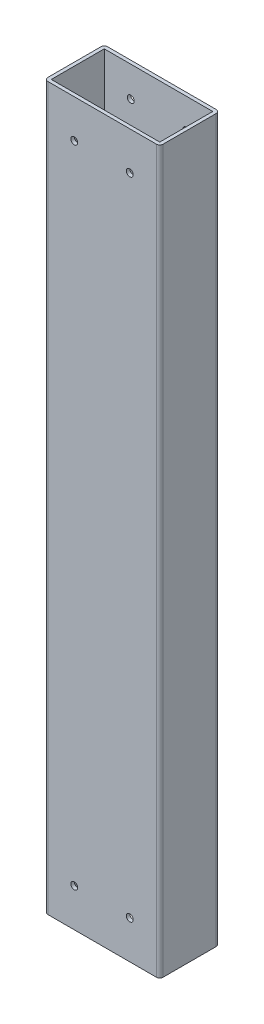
ISO-10303-21;
HEADER;
FILE_DESCRIPTION(('STEP AP214'),'2;1');
FILE_NAME('part.step','',(''),(''),'','','');
FILE_SCHEMA(('AUTOMOTIVE_DESIGN { 1 0 10303 214 1 1 1 1 }'));
ENDSEC;
DATA;
#1=APPLICATION_CONTEXT('core data for automotive mechanical design processes');
#2=APPLICATION_PROTOCOL_DEFINITION('international standard','automotive_design',2000,#1);
#3=PRODUCT_CONTEXT('',#1,'mechanical');
#4=PRODUCT('Part','Part','',(#3));
#5=PRODUCT_RELATED_PRODUCT_CATEGORY('part','',(#4));
#6=PRODUCT_DEFINITION_FORMATION('','',#4);
#7=PRODUCT_DEFINITION_CONTEXT('part definition',#1,'design');
#8=PRODUCT_DEFINITION('design','',#6,#7);
#9=PRODUCT_DEFINITION_SHAPE('','',#8);
#10=(LENGTH_UNIT() NAMED_UNIT(*) SI_UNIT(.MILLI.,.METRE.));
#11=(NAMED_UNIT(*) PLANE_ANGLE_UNIT() SI_UNIT($,.RADIAN.));
#12=(NAMED_UNIT(*) SI_UNIT($,.STERADIAN.) SOLID_ANGLE_UNIT());
#13=UNCERTAINTY_MEASURE_WITH_UNIT(LENGTH_MEASURE(1.E-05),#10,'distance_accuracy_value','');
#14=(GEOMETRIC_REPRESENTATION_CONTEXT(3) GLOBAL_UNCERTAINTY_ASSIGNED_CONTEXT((#13)) GLOBAL_UNIT_ASSIGNED_CONTEXT((#10,
#11,#12)) REPRESENTATION_CONTEXT('',''));
#15=CARTESIAN_POINT('',(0.,0.,0.));
#16=DIRECTION('',(0.,0.,1.));
#17=DIRECTION('',(1.,0.,0.));
#18=AXIS2_PLACEMENT_3D('',#15,#16,#17);
#19=CARTESIAN_POINT('',(-24.8285,165.1,12.1285));
#20=DIRECTION('',(0.,1.,0.));
#21=DIRECTION('',(0.,0.,1.));
#22=AXIS2_PLACEMENT_3D('',#19,#20,#21);
#23=PLANE('',#22);
#24=CARTESIAN_POINT('',(-24.8285,165.1,12.1285));
#25=DIRECTION('',(0.,1.,0.));
#26=DIRECTION('',(0.,0.,-1.));
#27=AXIS2_PLACEMENT_3D('',#24,#25,#26);
#28=CIRCLE('',#27,1.5875);
#29=CARTESIAN_POINT('',(-26.416,165.1,12.1285));
#30=VERTEX_POINT('',#29);
#31=CARTESIAN_POINT('',(-24.8285,165.1,13.716));
#32=VERTEX_POINT('',#31);
#33=EDGE_CURVE('E210',#30,#32,#28,.T.);
#34=ORIENTED_EDGE('',*,*,#33,.T.);
#35=DIRECTION('',(1.,0.,0.));
#36=VECTOR('',#35,1.);
#37=CARTESIAN_POINT('',(-24.8285,165.1,13.716));
#38=LINE('',#37,#36);
#39=CARTESIAN_POINT('',(24.8285,165.1,13.716));
#40=VERTEX_POINT('',#39);
#41=EDGE_CURVE('E213',#32,#40,#38,.T.);
#42=ORIENTED_EDGE('',*,*,#41,.T.);
#43=CARTESIAN_POINT('',(24.8285,165.1,12.1285));
#44=DIRECTION('',(0.,1.,0.));
#45=DIRECTION('',(0.,0.,1.));
#46=AXIS2_PLACEMENT_3D('',#43,#44,#45);
#47=CIRCLE('',#46,1.5875);
#48=CARTESIAN_POINT('',(26.416,165.1,12.1285));
#49=VERTEX_POINT('',#48);
#50=EDGE_CURVE('E216',#40,#49,#47,.T.);
#51=ORIENTED_EDGE('',*,*,#50,.T.);
#52=DIRECTION('',(0.,0.,-1.));
#53=VECTOR('',#52,1.);
#54=CARTESIAN_POINT('',(26.416,165.1,12.1285));
#55=LINE('',#54,#53);
#56=CARTESIAN_POINT('',(26.416,165.1,-12.1285));
#57=VERTEX_POINT('',#56);
#58=EDGE_CURVE('E218',#49,#57,#55,.T.);
#59=ORIENTED_EDGE('',*,*,#58,.T.);
#60=CARTESIAN_POINT('',(24.8285,165.1,-12.1285));
#61=DIRECTION('',(0.,1.,0.));
#62=DIRECTION('',(0.,0.,-1.));
#63=AXIS2_PLACEMENT_3D('',#60,#61,#62);
#64=CIRCLE('',#63,1.5875);
#65=CARTESIAN_POINT('',(24.8285,165.1,-13.716));
#66=VERTEX_POINT('',#65);
#67=EDGE_CURVE('E220',#57,#66,#64,.T.);
#68=ORIENTED_EDGE('',*,*,#67,.T.);
#69=DIRECTION('',(-1.,0.,0.));
#70=VECTOR('',#69,1.);
#71=CARTESIAN_POINT('',(-24.8285,165.1,-13.716));
#72=LINE('',#71,#70);
#73=CARTESIAN_POINT('',(-24.8285,165.1,-13.716));
#74=VERTEX_POINT('',#73);
#75=EDGE_CURVE('E222',#66,#74,#72,.T.);
#76=ORIENTED_EDGE('',*,*,#75,.T.);
#77=CARTESIAN_POINT('',(-24.8285,165.1,-12.1285));
#78=DIRECTION('',(0.,1.,0.));
#79=DIRECTION('',(0.,0.,-1.));
#80=AXIS2_PLACEMENT_3D('',#77,#78,#79);
#81=CIRCLE('',#80,1.5875);
#82=CARTESIAN_POINT('',(-26.416,165.1,-12.1285));
#83=VERTEX_POINT('',#82);
#84=EDGE_CURVE('E224',#74,#83,#81,.T.);
#85=ORIENTED_EDGE('',*,*,#84,.T.);
#86=DIRECTION('',(0.,0.,1.));
#87=VECTOR('',#86,1.);
#88=CARTESIAN_POINT('',(-26.416,165.1,12.1285));
#89=LINE('',#88,#87);
#90=EDGE_CURVE('E226',#83,#30,#89,.T.);
#91=ORIENTED_EDGE('',*,*,#90,.T.);
#92=EDGE_LOOP('',(#34,#42,#51,#59,#68,#76,#85,#91));
#93=FACE_BOUND('',#92,.T.);
#94=DIRECTION('',(1.,0.,0.));
#95=VECTOR('',#94,1.);
#96=CARTESIAN_POINT('',(-24.8285,165.1,12.1285));
#97=LINE('',#96,#95);
#98=CARTESIAN_POINT('',(-24.8285,165.1,12.1285));
#99=VERTEX_POINT('',#98);
#100=CARTESIAN_POINT('',(24.8285,165.1,12.1285));
#101=VERTEX_POINT('',#100);
#102=EDGE_CURVE('E180',#99,#101,#97,.T.);
#103=ORIENTED_EDGE('',*,*,#102,.F.);
#104=DIRECTION('',(0.,0.,1.));
#105=VECTOR('',#104,1.);
#106=CARTESIAN_POINT('',(-24.8285,165.1,12.1285));
#107=LINE('',#106,#105);
#108=CARTESIAN_POINT('',(-24.8285,165.1,-12.1285));
#109=VERTEX_POINT('',#108);
#110=EDGE_CURVE('E172',#109,#99,#107,.T.);
#111=ORIENTED_EDGE('',*,*,#110,.F.);
#112=DIRECTION('',(-1.,0.,0.));
#113=VECTOR('',#112,1.);
#114=CARTESIAN_POINT('',(-24.8285,165.1,-12.1285));
#115=LINE('',#114,#113);
#116=CARTESIAN_POINT('',(24.8285,165.1,-12.1285));
#117=VERTEX_POINT('',#116);
#118=EDGE_CURVE('E194',#117,#109,#115,.T.);
#119=ORIENTED_EDGE('',*,*,#118,.F.);
#120=DIRECTION('',(0.,0.,-1.));
#121=VECTOR('',#120,1.);
#122=CARTESIAN_POINT('',(24.8285,165.1,12.1285));
#123=LINE('',#122,#121);
#124=EDGE_CURVE('E192',#101,#117,#123,.T.);
#125=ORIENTED_EDGE('',*,*,#124,.F.);
#126=EDGE_LOOP('',(#103,#111,#119,#125));
#127=FACE_BOUND('',#126,.T.);
#128=ADVANCED_FACE('F81',(#93,#127),#23,.T.);
#129=CARTESIAN_POINT('',(-24.8285,-165.1,12.1285));
#130=DIRECTION('',(0.,1.,0.));
#131=DIRECTION('',(0.,0.,1.));
#132=AXIS2_PLACEMENT_3D('',#129,#130,#131);
#133=PLANE('',#132);
#134=CARTESIAN_POINT('',(-24.8285,-165.1,12.1285));
#135=DIRECTION('',(0.,1.,0.));
#136=DIRECTION('',(0.,0.,-1.));
#137=AXIS2_PLACEMENT_3D('',#134,#135,#136);
#138=CIRCLE('',#137,1.5875);
#139=CARTESIAN_POINT('',(-26.416,-165.1,12.1285));
#140=VERTEX_POINT('',#139);
#141=CARTESIAN_POINT('',(-24.8285,-165.1,13.716));
#142=VERTEX_POINT('',#141);
#143=EDGE_CURVE('E188',#140,#142,#138,.T.);
#144=ORIENTED_EDGE('',*,*,#143,.F.);
#145=DIRECTION('',(0.,0.,1.));
#146=VECTOR('',#145,1.);
#147=CARTESIAN_POINT('',(-26.416,-165.1,12.1285));
#148=LINE('',#147,#146);
#149=CARTESIAN_POINT('',(-26.416,-165.1,-12.1285));
#150=VERTEX_POINT('',#149);
#151=EDGE_CURVE('E214',#150,#140,#148,.T.);
#152=ORIENTED_EDGE('',*,*,#151,.F.);
#153=CARTESIAN_POINT('',(-24.8285,-165.1,-12.1285));
#154=DIRECTION('',(0.,1.,0.));
#155=DIRECTION('',(0.,0.,-1.));
#156=AXIS2_PLACEMENT_3D('',#153,#154,#155);
#157=CIRCLE('',#156,1.5875);
#158=CARTESIAN_POINT('',(-24.8285,-165.1,-13.716));
#159=VERTEX_POINT('',#158);
#160=EDGE_CURVE('E241',#159,#150,#157,.T.);
#161=ORIENTED_EDGE('',*,*,#160,.F.);
#162=DIRECTION('',(-1.,0.,0.));
#163=VECTOR('',#162,1.);
#164=CARTESIAN_POINT('',(-24.8285,-165.1,-13.716));
#165=LINE('',#164,#163);
#166=CARTESIAN_POINT('',(24.8285,-165.1,-13.716));
#167=VERTEX_POINT('',#166);
#168=EDGE_CURVE('E239',#167,#159,#165,.T.);
#169=ORIENTED_EDGE('',*,*,#168,.F.);
#170=CARTESIAN_POINT('',(24.8285,-165.1,-12.1285));
#171=DIRECTION('',(0.,1.,0.));
#172=DIRECTION('',(0.,0.,-1.));
#173=AXIS2_PLACEMENT_3D('',#170,#171,#172);
#174=CIRCLE('',#173,1.5875);
#175=CARTESIAN_POINT('',(26.416,-165.1,-12.1285));
#176=VERTEX_POINT('',#175);
#177=EDGE_CURVE('E237',#176,#167,#174,.T.);
#178=ORIENTED_EDGE('',*,*,#177,.F.);
#179=DIRECTION('',(0.,0.,-1.));
#180=VECTOR('',#179,1.);
#181=CARTESIAN_POINT('',(26.416,-165.1,12.1285));
#182=LINE('',#181,#180);
#183=CARTESIAN_POINT('',(26.416,-165.1,12.1285));
#184=VERTEX_POINT('',#183);
#185=EDGE_CURVE('E235',#184,#176,#182,.T.);
#186=ORIENTED_EDGE('',*,*,#185,.F.);
#187=CARTESIAN_POINT('',(24.8285,-165.1,12.1285));
#188=DIRECTION('',(0.,1.,0.));
#189=DIRECTION('',(0.,0.,1.));
#190=AXIS2_PLACEMENT_3D('',#187,#188,#189);
#191=CIRCLE('',#190,1.5875);
#192=CARTESIAN_POINT('',(24.8285,-165.1,13.716));
#193=VERTEX_POINT('',#192);
#194=EDGE_CURVE('E233',#193,#184,#191,.T.);
#195=ORIENTED_EDGE('',*,*,#194,.F.);
#196=DIRECTION('',(1.,0.,0.));
#197=VECTOR('',#196,1.);
#198=CARTESIAN_POINT('',(-24.8285,-165.1,13.716));
#199=LINE('',#198,#197);
#200=EDGE_CURVE('E231',#142,#193,#199,.T.);
#201=ORIENTED_EDGE('',*,*,#200,.F.);
#202=EDGE_LOOP('',(#144,#152,#161,#169,#178,#186,#195,#201));
#203=FACE_BOUND('',#202,.T.);
#204=DIRECTION('',(0.,0.,1.));
#205=VECTOR('',#204,1.);
#206=CARTESIAN_POINT('',(-24.8285,-165.1,12.1285));
#207=LINE('',#206,#205);
#208=CARTESIAN_POINT('',(-24.8285,-165.1,-12.1285));
#209=VERTEX_POINT('',#208);
#210=CARTESIAN_POINT('',(-24.8285,-165.1,12.1285));
#211=VERTEX_POINT('',#210);
#212=EDGE_CURVE('E106',#209,#211,#207,.T.);
#213=ORIENTED_EDGE('',*,*,#212,.T.);
#214=DIRECTION('',(1.,0.,0.));
#215=VECTOR('',#214,1.);
#216=CARTESIAN_POINT('',(-24.8285,-165.1,12.1285));
#217=LINE('',#216,#215);
#218=CARTESIAN_POINT('',(24.8285,-165.1,12.1285));
#219=VERTEX_POINT('',#218);
#220=EDGE_CURVE('E187',#211,#219,#217,.T.);
#221=ORIENTED_EDGE('',*,*,#220,.T.);
#222=DIRECTION('',(0.,0.,-1.));
#223=VECTOR('',#222,1.);
#224=CARTESIAN_POINT('',(24.8285,-165.1,12.1285));
#225=LINE('',#224,#223);
#226=CARTESIAN_POINT('',(24.8285,-165.1,-12.1285));
#227=VERTEX_POINT('',#226);
#228=EDGE_CURVE('E202',#219,#227,#225,.T.);
#229=ORIENTED_EDGE('',*,*,#228,.T.);
#230=DIRECTION('',(-1.,0.,0.));
#231=VECTOR('',#230,1.);
#232=CARTESIAN_POINT('',(-24.8285,-165.1,-12.1285));
#233=LINE('',#232,#231);
#234=EDGE_CURVE('E181',#227,#209,#233,.T.);
#235=ORIENTED_EDGE('',*,*,#234,.T.);
#236=EDGE_LOOP('',(#213,#221,#229,#235));
#237=FACE_BOUND('',#236,.T.);
#238=ADVANCED_FACE('F335',(#203,#237),#133,.F.);
#239=CARTESIAN_POINT('',(-24.8285,165.1,12.1285));
#240=DIRECTION('',(0.,-1.,0.));
#241=DIRECTION('',(0.,0.,-1.));
#242=AXIS2_PLACEMENT_3D('',#239,#240,#241);
#243=CYLINDRICAL_SURFACE('',#242,1.5875);
#244=ORIENTED_EDGE('',*,*,#143,.T.);
#245=DIRECTION('',(0.,-1.,0.));
#246=VECTOR('',#245,1.);
#247=CARTESIAN_POINT('',(-24.8285,165.1,13.716));
#248=LINE('',#247,#246);
#249=EDGE_CURVE('E12',#32,#142,#248,.T.);
#250=ORIENTED_EDGE('',*,*,#249,.F.);
#251=ORIENTED_EDGE('',*,*,#33,.F.);
#252=DIRECTION('',(0.,-1.,0.));
#253=VECTOR('',#252,1.);
#254=CARTESIAN_POINT('',(-26.416,165.1,12.1285));
#255=LINE('',#254,#253);
#256=EDGE_CURVE('E228',#30,#140,#255,.T.);
#257=ORIENTED_EDGE('',*,*,#256,.T.);
#258=EDGE_LOOP('',(#244,#250,#251,#257));
#259=FACE_BOUND('',#258,.T.);
#260=ADVANCED_FACE('F83',(#259),#243,.T.);
#261=CARTESIAN_POINT('',(-24.8285,165.1,13.716));
#262=DIRECTION('',(0.,0.,-1.));
#263=DIRECTION('',(-1.,0.,0.));
#264=AXIS2_PLACEMENT_3D('',#261,#262,#263);
#265=PLANE('',#264);
#266=CARTESIAN_POINT('',(12.699999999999,147.6375,13.716));
#267=DIRECTION('',(0.,0.,1.));
#268=DIRECTION('',(1.,0.,0.));
#269=AXIS2_PLACEMENT_3D('',#266,#267,#268);
#270=CIRCLE('',#269,1.58749999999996);
#271=CARTESIAN_POINT('',(14.2874999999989,147.6375,13.716));
#272=VERTEX_POINT('',#271);
#273=EDGE_CURVE('E308',#272,#272,#270,.T.);
#274=ORIENTED_EDGE('',*,*,#273,.F.);
#275=EDGE_LOOP('',(#274));
#276=FACE_BOUND('',#275,.T.);
#277=CARTESIAN_POINT('',(-12.6999999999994,147.6375,13.716));
#278=DIRECTION('',(0.,0.,1.));
#279=DIRECTION('',(1.,0.,0.));
#280=AXIS2_PLACEMENT_3D('',#277,#278,#279);
#281=CIRCLE('',#280,1.5875);
#282=CARTESIAN_POINT('',(-11.1124999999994,147.6375,13.716));
#283=VERTEX_POINT('',#282);
#284=EDGE_CURVE('E311',#283,#283,#281,.T.);
#285=ORIENTED_EDGE('',*,*,#284,.F.);
#286=EDGE_LOOP('',(#285));
#287=FACE_BOUND('',#286,.T.);
#288=CARTESIAN_POINT('',(-12.6999999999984,-147.6375,13.716));
#289=DIRECTION('',(0.,0.,1.));
#290=DIRECTION('',(1.,0.,0.));
#291=AXIS2_PLACEMENT_3D('',#288,#289,#290);
#292=CIRCLE('',#291,1.5875);
#293=CARTESIAN_POINT('',(-11.1124999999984,-147.6375,13.716));
#294=VERTEX_POINT('',#293);
#295=EDGE_CURVE('E307',#294,#294,#292,.T.);
#296=ORIENTED_EDGE('',*,*,#295,.F.);
#297=EDGE_LOOP('',(#296));
#298=FACE_BOUND('',#297,.T.);
#299=CARTESIAN_POINT('',(12.7,-147.6375,13.716));
#300=DIRECTION('',(0.,0.,1.));
#301=DIRECTION('',(1.,0.,0.));
#302=AXIS2_PLACEMENT_3D('',#299,#300,#301);
#303=CIRCLE('',#302,1.58749999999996);
#304=CARTESIAN_POINT('',(14.2874999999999,-147.6375,13.716));
#305=VERTEX_POINT('',#304);
#306=EDGE_CURVE('E279',#305,#305,#303,.T.);
#307=ORIENTED_EDGE('',*,*,#306,.F.);
#308=EDGE_LOOP('',(#307));
#309=FACE_BOUND('',#308,.T.);
#310=ORIENTED_EDGE('',*,*,#200,.T.);
#311=DIRECTION('',(0.,-1.,0.));
#312=VECTOR('',#311,1.);
#313=CARTESIAN_POINT('',(24.8285,165.1,13.716));
#314=LINE('',#313,#312);
#315=EDGE_CURVE('E90',#40,#193,#314,.T.);
#316=ORIENTED_EDGE('',*,*,#315,.F.);
#317=ORIENTED_EDGE('',*,*,#41,.F.);
#318=ORIENTED_EDGE('',*,*,#249,.T.);
#319=EDGE_LOOP('',(#310,#316,#317,#318));
#320=FACE_BOUND('',#319,.T.);
#321=ADVANCED_FACE('F319',(#276,#287,#298,#309,#320),#265,.F.);
#322=CARTESIAN_POINT('',(24.8285,165.1,12.1285));
#323=DIRECTION('',(0.,-1.,0.));
#324=DIRECTION('',(0.,0.,-1.));
#325=AXIS2_PLACEMENT_3D('',#322,#323,#324);
#326=CYLINDRICAL_SURFACE('',#325,1.5875);
#327=ORIENTED_EDGE('',*,*,#194,.T.);
#328=DIRECTION('',(0.,-1.,0.));
#329=VECTOR('',#328,1.);
#330=CARTESIAN_POINT('',(26.416,165.1,12.1285));
#331=LINE('',#330,#329);
#332=EDGE_CURVE('E258',#49,#184,#331,.T.);
#333=ORIENTED_EDGE('',*,*,#332,.F.);
#334=ORIENTED_EDGE('',*,*,#50,.F.);
#335=ORIENTED_EDGE('',*,*,#315,.T.);
#336=EDGE_LOOP('',(#327,#333,#334,#335));
#337=FACE_BOUND('',#336,.T.);
#338=ADVANCED_FACE('F322',(#337),#326,.T.);
#339=CARTESIAN_POINT('',(26.416,165.1,12.1285));
#340=DIRECTION('',(-1.,0.,0.));
#341=DIRECTION('',(0.,0.,1.));
#342=AXIS2_PLACEMENT_3D('',#339,#340,#341);
#343=PLANE('',#342);
#344=ORIENTED_EDGE('',*,*,#185,.T.);
#345=DIRECTION('',(0.,-1.,0.));
#346=VECTOR('',#345,1.);
#347=CARTESIAN_POINT('',(26.416,165.1,-12.1285));
#348=LINE('',#347,#346);
#349=EDGE_CURVE('E255',#57,#176,#348,.T.);
#350=ORIENTED_EDGE('',*,*,#349,.F.);
#351=ORIENTED_EDGE('',*,*,#58,.F.);
#352=ORIENTED_EDGE('',*,*,#332,.T.);
#353=EDGE_LOOP('',(#344,#350,#351,#352));
#354=FACE_BOUND('',#353,.T.);
#355=ADVANCED_FACE('F341',(#354),#343,.F.);
#356=CARTESIAN_POINT('',(24.8285,165.1,-12.1285));
#357=DIRECTION('',(0.,-1.,0.));
#358=DIRECTION('',(0.,0.,-1.));
#359=AXIS2_PLACEMENT_3D('',#356,#357,#358);
#360=CYLINDRICAL_SURFACE('',#359,1.5875);
#361=ORIENTED_EDGE('',*,*,#177,.T.);
#362=DIRECTION('',(0.,-1.,0.));
#363=VECTOR('',#362,1.);
#364=CARTESIAN_POINT('',(24.8285,165.1,-13.716));
#365=LINE('',#364,#363);
#366=EDGE_CURVE('E252',#66,#167,#365,.T.);
#367=ORIENTED_EDGE('',*,*,#366,.F.);
#368=ORIENTED_EDGE('',*,*,#67,.F.);
#369=ORIENTED_EDGE('',*,*,#349,.T.);
#370=EDGE_LOOP('',(#361,#367,#368,#369));
#371=FACE_BOUND('',#370,.T.);
#372=ADVANCED_FACE('F345',(#371),#360,.T.);
#373=CARTESIAN_POINT('',(-24.8285,165.1,-13.716));
#374=DIRECTION('',(0.,0.,1.));
#375=DIRECTION('',(1.,0.,0.));
#376=AXIS2_PLACEMENT_3D('',#373,#374,#375);
#377=PLANE('',#376);
#378=CARTESIAN_POINT('',(-12.6999999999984,-151.257,-13.716));
#379=DIRECTION('',(0.,0.,1.));
#380=DIRECTION('',(1.,0.,0.));
#381=AXIS2_PLACEMENT_3D('',#378,#379,#380);
#382=CIRCLE('',#381,1.5875);
#383=CARTESIAN_POINT('',(-11.1124999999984,-151.257,-13.716));
#384=VERTEX_POINT('',#383);
#385=EDGE_CURVE('E286',#384,#384,#382,.T.);
#386=ORIENTED_EDGE('',*,*,#385,.T.);
#387=EDGE_LOOP('',(#386));
#388=FACE_BOUND('',#387,.T.);
#389=CARTESIAN_POINT('',(12.7,-151.257,-13.716));
#390=DIRECTION('',(0.,0.,1.));
#391=DIRECTION('',(1.,0.,0.));
#392=AXIS2_PLACEMENT_3D('',#389,#390,#391);
#393=CIRCLE('',#392,1.5875);
#394=CARTESIAN_POINT('',(14.2875,-151.257,-13.716));
#395=VERTEX_POINT('',#394);
#396=EDGE_CURVE('E290',#395,#395,#393,.T.);
#397=ORIENTED_EDGE('',*,*,#396,.T.);
#398=EDGE_LOOP('',(#397));
#399=FACE_BOUND('',#398,.T.);
#400=CARTESIAN_POINT('',(12.7,151.257,-13.716));
#401=DIRECTION('',(0.,0.,1.));
#402=DIRECTION('',(1.,0.,0.));
#403=AXIS2_PLACEMENT_3D('',#400,#401,#402);
#404=CIRCLE('',#403,1.5875);
#405=CARTESIAN_POINT('',(14.2875,151.257,-13.716));
#406=VERTEX_POINT('',#405);
#407=EDGE_CURVE('E295',#406,#406,#404,.T.);
#408=ORIENTED_EDGE('',*,*,#407,.T.);
#409=EDGE_LOOP('',(#408));
#410=FACE_BOUND('',#409,.T.);
#411=CARTESIAN_POINT('',(-12.7,151.257,-13.716));
#412=DIRECTION('',(0.,0.,1.));
#413=DIRECTION('',(1.,0.,0.));
#414=AXIS2_PLACEMENT_3D('',#411,#412,#413);
#415=CIRCLE('',#414,1.5875);
#416=CARTESIAN_POINT('',(-11.1125,151.257,-13.716));
#417=VERTEX_POINT('',#416);
#418=EDGE_CURVE('E267',#417,#417,#415,.T.);
#419=ORIENTED_EDGE('',*,*,#418,.T.);
#420=EDGE_LOOP('',(#419));
#421=FACE_BOUND('',#420,.T.);
#422=ORIENTED_EDGE('',*,*,#168,.T.);
#423=DIRECTION('',(0.,-1.,0.));
#424=VECTOR('',#423,1.);
#425=CARTESIAN_POINT('',(-24.8285,165.1,-13.716));
#426=LINE('',#425,#424);
#427=EDGE_CURVE('E249',#74,#159,#426,.T.);
#428=ORIENTED_EDGE('',*,*,#427,.F.);
#429=ORIENTED_EDGE('',*,*,#75,.F.);
#430=ORIENTED_EDGE('',*,*,#366,.T.);
#431=EDGE_LOOP('',(#422,#428,#429,#430));
#432=FACE_BOUND('',#431,.T.);
#433=ADVANCED_FACE('F363',(#388,#399,#410,#421,#432),#377,.F.);
#434=CARTESIAN_POINT('',(-24.8285,165.1,-12.1285));
#435=DIRECTION('',(0.,-1.,0.));
#436=DIRECTION('',(0.,0.,-1.));
#437=AXIS2_PLACEMENT_3D('',#434,#435,#436);
#438=CYLINDRICAL_SURFACE('',#437,1.5875);
#439=ORIENTED_EDGE('',*,*,#160,.T.);
#440=DIRECTION('',(0.,-1.,0.));
#441=VECTOR('',#440,1.);
#442=CARTESIAN_POINT('',(-26.416,165.1,-12.1285));
#443=LINE('',#442,#441);
#444=EDGE_CURVE('E246',#83,#150,#443,.T.);
#445=ORIENTED_EDGE('',*,*,#444,.F.);
#446=ORIENTED_EDGE('',*,*,#84,.F.);
#447=ORIENTED_EDGE('',*,*,#427,.T.);
#448=EDGE_LOOP('',(#439,#445,#446,#447));
#449=FACE_BOUND('',#448,.T.);
#450=ADVANCED_FACE('F361',(#449),#438,.T.);
#451=CARTESIAN_POINT('',(-26.416,165.1,12.1285));
#452=DIRECTION('',(1.,0.,0.));
#453=DIRECTION('',(0.,0.,-1.));
#454=AXIS2_PLACEMENT_3D('',#451,#452,#453);
#455=PLANE('',#454);
#456=ORIENTED_EDGE('',*,*,#151,.T.);
#457=ORIENTED_EDGE('',*,*,#256,.F.);
#458=ORIENTED_EDGE('',*,*,#90,.F.);
#459=ORIENTED_EDGE('',*,*,#444,.T.);
#460=EDGE_LOOP('',(#456,#457,#458,#459));
#461=FACE_BOUND('',#460,.T.);
#462=ADVANCED_FACE('F357',(#461),#455,.F.);
#463=CARTESIAN_POINT('',(-24.8285,165.1,12.1285));
#464=DIRECTION('',(1.,0.,0.));
#465=DIRECTION('',(0.,0.,-1.));
#466=AXIS2_PLACEMENT_3D('',#463,#464,#465);
#467=PLANE('',#466);
#468=ORIENTED_EDGE('',*,*,#212,.F.);
#469=DIRECTION('',(0.,-1.,0.));
#470=VECTOR('',#469,1.);
#471=CARTESIAN_POINT('',(-24.8285,165.1,-12.1285));
#472=LINE('',#471,#470);
#473=EDGE_CURVE('E176',#109,#209,#472,.T.);
#474=ORIENTED_EDGE('',*,*,#473,.F.);
#475=ORIENTED_EDGE('',*,*,#110,.T.);
#476=DIRECTION('',(0.,-1.,0.));
#477=VECTOR('',#476,1.);
#478=CARTESIAN_POINT('',(-24.8285,165.1,12.1285));
#479=LINE('',#478,#477);
#480=EDGE_CURVE('E175',#99,#211,#479,.T.);
#481=ORIENTED_EDGE('',*,*,#480,.T.);
#482=EDGE_LOOP('',(#468,#474,#475,#481));
#483=FACE_BOUND('',#482,.T.);
#484=ADVANCED_FACE('F174',(#483),#467,.T.);
#485=CARTESIAN_POINT('',(-24.8285,165.1,12.1285));
#486=DIRECTION('',(0.,0.,-1.));
#487=DIRECTION('',(-1.,0.,0.));
#488=AXIS2_PLACEMENT_3D('',#485,#486,#487);
#489=PLANE('',#488);
#490=CARTESIAN_POINT('',(12.699999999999,147.6375,12.1285));
#491=DIRECTION('',(0.,0.,-1.));
#492=DIRECTION('',(-1.,0.,0.));
#493=AXIS2_PLACEMENT_3D('',#490,#491,#492);
#494=CIRCLE('',#493,1.58749999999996);
#495=CARTESIAN_POINT('',(11.112499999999,147.6375,12.1285));
#496=VERTEX_POINT('',#495);
#497=EDGE_CURVE('E85',#496,#496,#494,.F.);
#498=ORIENTED_EDGE('',*,*,#497,.T.);
#499=EDGE_LOOP('',(#498));
#500=FACE_BOUND('',#499,.T.);
#501=CARTESIAN_POINT('',(-12.6999999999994,147.6375,12.1285));
#502=DIRECTION('',(0.,0.,-1.));
#503=DIRECTION('',(-1.,0.,0.));
#504=AXIS2_PLACEMENT_3D('',#501,#502,#503);
#505=CIRCLE('',#504,1.5875);
#506=CARTESIAN_POINT('',(-14.2874999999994,147.6375,12.1285));
#507=VERTEX_POINT('',#506);
#508=EDGE_CURVE('E281',#507,#507,#505,.F.);
#509=ORIENTED_EDGE('',*,*,#508,.T.);
#510=EDGE_LOOP('',(#509));
#511=FACE_BOUND('',#510,.T.);
#512=CARTESIAN_POINT('',(-12.6999999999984,-147.6375,12.1285));
#513=DIRECTION('',(0.,0.,-1.));
#514=DIRECTION('',(-1.,0.,0.));
#515=AXIS2_PLACEMENT_3D('',#512,#513,#514);
#516=CIRCLE('',#515,1.5875);
#517=CARTESIAN_POINT('',(-14.2874999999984,-147.6375,12.1285));
#518=VERTEX_POINT('',#517);
#519=EDGE_CURVE('E278',#518,#518,#516,.F.);
#520=ORIENTED_EDGE('',*,*,#519,.T.);
#521=EDGE_LOOP('',(#520));
#522=FACE_BOUND('',#521,.T.);
#523=CARTESIAN_POINT('',(12.7,-147.6375,12.1285));
#524=DIRECTION('',(0.,0.,-1.));
#525=DIRECTION('',(-1.,0.,0.));
#526=AXIS2_PLACEMENT_3D('',#523,#524,#525);
#527=CIRCLE('',#526,1.58749999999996);
#528=CARTESIAN_POINT('',(11.1125,-147.6375,12.1285));
#529=VERTEX_POINT('',#528);
#530=EDGE_CURVE('E275',#529,#529,#527,.F.);
#531=ORIENTED_EDGE('',*,*,#530,.T.);
#532=EDGE_LOOP('',(#531));
#533=FACE_BOUND('',#532,.T.);
#534=ORIENTED_EDGE('',*,*,#220,.F.);
#535=ORIENTED_EDGE('',*,*,#480,.F.);
#536=ORIENTED_EDGE('',*,*,#102,.T.);
#537=DIRECTION('',(0.,-1.,0.));
#538=VECTOR('',#537,1.);
#539=CARTESIAN_POINT('',(24.8285,165.1,12.1285));
#540=LINE('',#539,#538);
#541=EDGE_CURVE('E189',#101,#219,#540,.T.);
#542=ORIENTED_EDGE('',*,*,#541,.T.);
#543=EDGE_LOOP('',(#534,#535,#536,#542));
#544=FACE_BOUND('',#543,.T.);
#545=ADVANCED_FACE('F184',(#500,#511,#522,#533,#544),#489,.T.);
#546=CARTESIAN_POINT('',(24.8285,165.1,12.1285));
#547=DIRECTION('',(-1.,0.,0.));
#548=DIRECTION('',(0.,0.,1.));
#549=AXIS2_PLACEMENT_3D('',#546,#547,#548);
#550=PLANE('',#549);
#551=ORIENTED_EDGE('',*,*,#228,.F.);
#552=ORIENTED_EDGE('',*,*,#541,.F.);
#553=ORIENTED_EDGE('',*,*,#124,.T.);
#554=DIRECTION('',(0.,-1.,0.));
#555=VECTOR('',#554,1.);
#556=CARTESIAN_POINT('',(24.8285,165.1,-12.1285));
#557=LINE('',#556,#555);
#558=EDGE_CURVE('E98',#117,#227,#557,.T.);
#559=ORIENTED_EDGE('',*,*,#558,.T.);
#560=EDGE_LOOP('',(#551,#552,#553,#559));
#561=FACE_BOUND('',#560,.T.);
#562=ADVANCED_FACE('F391',(#561),#550,.T.);
#563=CARTESIAN_POINT('',(-24.8285,165.1,-12.1285));
#564=DIRECTION('',(0.,0.,1.));
#565=DIRECTION('',(1.,0.,0.));
#566=AXIS2_PLACEMENT_3D('',#563,#564,#565);
#567=PLANE('',#566);
#568=CARTESIAN_POINT('',(-12.6999999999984,-151.257,-12.1285));
#569=DIRECTION('',(0.,0.,1.));
#570=DIRECTION('',(1.,0.,0.));
#571=AXIS2_PLACEMENT_3D('',#568,#569,#570);
#572=CIRCLE('',#571,1.5875);
#573=CARTESIAN_POINT('',(-11.1124999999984,-151.257,-12.1285));
#574=VERTEX_POINT('',#573);
#575=EDGE_CURVE('E200',#574,#574,#572,.T.);
#576=ORIENTED_EDGE('',*,*,#575,.F.);
#577=EDGE_LOOP('',(#576));
#578=FACE_BOUND('',#577,.T.);
#579=CARTESIAN_POINT('',(12.7,-151.257,-12.1285));
#580=DIRECTION('',(0.,0.,1.));
#581=DIRECTION('',(1.,0.,0.));
#582=AXIS2_PLACEMENT_3D('',#579,#580,#581);
#583=CIRCLE('',#582,1.5875);
#584=CARTESIAN_POINT('',(14.2875,-151.257,-12.1285));
#585=VERTEX_POINT('',#584);
#586=EDGE_CURVE('E270',#585,#585,#583,.T.);
#587=ORIENTED_EDGE('',*,*,#586,.F.);
#588=EDGE_LOOP('',(#587));
#589=FACE_BOUND('',#588,.T.);
#590=CARTESIAN_POINT('',(12.7,151.257,-12.1285));
#591=DIRECTION('',(0.,0.,1.));
#592=DIRECTION('',(1.,0.,0.));
#593=AXIS2_PLACEMENT_3D('',#590,#591,#592);
#594=CIRCLE('',#593,1.5875);
#595=CARTESIAN_POINT('',(14.2875,151.257,-12.1285));
#596=VERTEX_POINT('',#595);
#597=EDGE_CURVE('E266',#596,#596,#594,.T.);
#598=ORIENTED_EDGE('',*,*,#597,.F.);
#599=EDGE_LOOP('',(#598));
#600=FACE_BOUND('',#599,.T.);
#601=CARTESIAN_POINT('',(-12.7,151.257,-12.1285));
#602=DIRECTION('',(0.,0.,1.));
#603=DIRECTION('',(1.,0.,0.));
#604=AXIS2_PLACEMENT_3D('',#601,#602,#603);
#605=CIRCLE('',#604,1.5875);
#606=CARTESIAN_POINT('',(-11.1125,151.257,-12.1285));
#607=VERTEX_POINT('',#606);
#608=EDGE_CURVE('E263',#607,#607,#605,.T.);
#609=ORIENTED_EDGE('',*,*,#608,.F.);
#610=EDGE_LOOP('',(#609));
#611=FACE_BOUND('',#610,.T.);
#612=ORIENTED_EDGE('',*,*,#234,.F.);
#613=ORIENTED_EDGE('',*,*,#558,.F.);
#614=ORIENTED_EDGE('',*,*,#118,.T.);
#615=ORIENTED_EDGE('',*,*,#473,.T.);
#616=EDGE_LOOP('',(#612,#613,#614,#615));
#617=FACE_BOUND('',#616,.T.);
#618=ADVANCED_FACE('F395',(#578,#589,#600,#611,#617),#567,.T.);
#619=CARTESIAN_POINT('',(-12.7,151.257,-13.716));
#620=DIRECTION('',(0.,0.,1.));
#621=DIRECTION('',(1.,0.,0.));
#622=AXIS2_PLACEMENT_3D('',#619,#620,#621);
#623=CYLINDRICAL_SURFACE('',#622,1.5875);
#624=ORIENTED_EDGE('',*,*,#608,.T.);
#625=EDGE_LOOP('',(#624));
#626=FACE_BOUND('',#625,.T.);
#627=ORIENTED_EDGE('',*,*,#418,.F.);
#628=EDGE_LOOP('',(#627));
#629=FACE_BOUND('',#628,.T.);
#630=ADVANCED_FACE('F400',(#626,#629),#623,.F.);
#631=CARTESIAN_POINT('',(12.7,151.257,-13.716));
#632=DIRECTION('',(0.,0.,1.));
#633=DIRECTION('',(1.,0.,0.));
#634=AXIS2_PLACEMENT_3D('',#631,#632,#633);
#635=CYLINDRICAL_SURFACE('',#634,1.5875);
#636=ORIENTED_EDGE('',*,*,#597,.T.);
#637=EDGE_LOOP('',(#636));
#638=FACE_BOUND('',#637,.T.);
#639=ORIENTED_EDGE('',*,*,#407,.F.);
#640=EDGE_LOOP('',(#639));
#641=FACE_BOUND('',#640,.T.);
#642=ADVANCED_FACE('F404',(#638,#641),#635,.F.);
#643=CARTESIAN_POINT('',(12.7,-151.257,-13.716));
#644=DIRECTION('',(0.,0.,1.));
#645=DIRECTION('',(1.,0.,0.));
#646=AXIS2_PLACEMENT_3D('',#643,#644,#645);
#647=CYLINDRICAL_SURFACE('',#646,1.5875);
#648=ORIENTED_EDGE('',*,*,#586,.T.);
#649=EDGE_LOOP('',(#648));
#650=FACE_BOUND('',#649,.T.);
#651=ORIENTED_EDGE('',*,*,#396,.F.);
#652=EDGE_LOOP('',(#651));
#653=FACE_BOUND('',#652,.T.);
#654=ADVANCED_FACE('F410',(#650,#653),#647,.F.);
#655=CARTESIAN_POINT('',(-12.6999999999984,-151.257,-13.716));
#656=DIRECTION('',(0.,0.,1.));
#657=DIRECTION('',(1.,0.,0.));
#658=AXIS2_PLACEMENT_3D('',#655,#656,#657);
#659=CYLINDRICAL_SURFACE('',#658,1.5875);
#660=ORIENTED_EDGE('',*,*,#575,.T.);
#661=EDGE_LOOP('',(#660));
#662=FACE_BOUND('',#661,.T.);
#663=ORIENTED_EDGE('',*,*,#385,.F.);
#664=EDGE_LOOP('',(#663));
#665=FACE_BOUND('',#664,.T.);
#666=ADVANCED_FACE('F406',(#662,#665),#659,.F.);
#667=CARTESIAN_POINT('',(12.7,-147.6375,13.716));
#668=DIRECTION('',(0.,0.,-1.));
#669=DIRECTION('',(-1.,0.,0.));
#670=AXIS2_PLACEMENT_3D('',#667,#668,#669);
#671=CYLINDRICAL_SURFACE('',#670,1.58749999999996);
#672=ORIENTED_EDGE('',*,*,#530,.F.);
#673=EDGE_LOOP('',(#672));
#674=FACE_BOUND('',#673,.T.);
#675=ORIENTED_EDGE('',*,*,#306,.T.);
#676=EDGE_LOOP('',(#675));
#677=FACE_BOUND('',#676,.T.);
#678=ADVANCED_FACE('F409',(#674,#677),#671,.F.);
#679=CARTESIAN_POINT('',(-12.6999999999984,-147.6375,13.716));
#680=DIRECTION('',(0.,0.,-1.));
#681=DIRECTION('',(-1.,0.,0.));
#682=AXIS2_PLACEMENT_3D('',#679,#680,#681);
#683=CYLINDRICAL_SURFACE('',#682,1.5875);
#684=ORIENTED_EDGE('',*,*,#519,.F.);
#685=EDGE_LOOP('',(#684));
#686=FACE_BOUND('',#685,.T.);
#687=ORIENTED_EDGE('',*,*,#295,.T.);
#688=EDGE_LOOP('',(#687));
#689=FACE_BOUND('',#688,.T.);
#690=ADVANCED_FACE('F317',(#686,#689),#683,.F.);
#691=CARTESIAN_POINT('',(-12.6999999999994,147.6375,13.716));
#692=DIRECTION('',(0.,0.,-1.));
#693=DIRECTION('',(-1.,0.,0.));
#694=AXIS2_PLACEMENT_3D('',#691,#692,#693);
#695=CYLINDRICAL_SURFACE('',#694,1.5875);
#696=ORIENTED_EDGE('',*,*,#508,.F.);
#697=EDGE_LOOP('',(#696));
#698=FACE_BOUND('',#697,.T.);
#699=ORIENTED_EDGE('',*,*,#284,.T.);
#700=EDGE_LOOP('',(#699));
#701=FACE_BOUND('',#700,.T.);
#702=ADVANCED_FACE('F423',(#698,#701),#695,.F.);
#703=CARTESIAN_POINT('',(12.699999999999,147.6375,13.716));
#704=DIRECTION('',(0.,0.,-1.));
#705=DIRECTION('',(-1.,0.,0.));
#706=AXIS2_PLACEMENT_3D('',#703,#704,#705);
#707=CYLINDRICAL_SURFACE('',#706,1.58749999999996);
#708=ORIENTED_EDGE('',*,*,#497,.F.);
#709=EDGE_LOOP('',(#708));
#710=FACE_BOUND('',#709,.T.);
#711=ORIENTED_EDGE('',*,*,#273,.T.);
#712=EDGE_LOOP('',(#711));
#713=FACE_BOUND('',#712,.T.);
#714=ADVANCED_FACE('F420',(#710,#713),#707,.F.);
#715=CLOSED_SHELL('',(#128,#238,#260,#321,#338,#355,#372,#433,#450,#462,#484,#545,#562,#618,
#630,#642,#654,#666,#678,#690,#702,#714));
#716=MANIFOLD_SOLID_BREP('B2',#715);
#717=ADVANCED_BREP_SHAPE_REPRESENTATION('',(#18,#716),#14);
#718=SHAPE_DEFINITION_REPRESENTATION(#9,#717);
ENDSEC;
END-ISO-10303-21;
